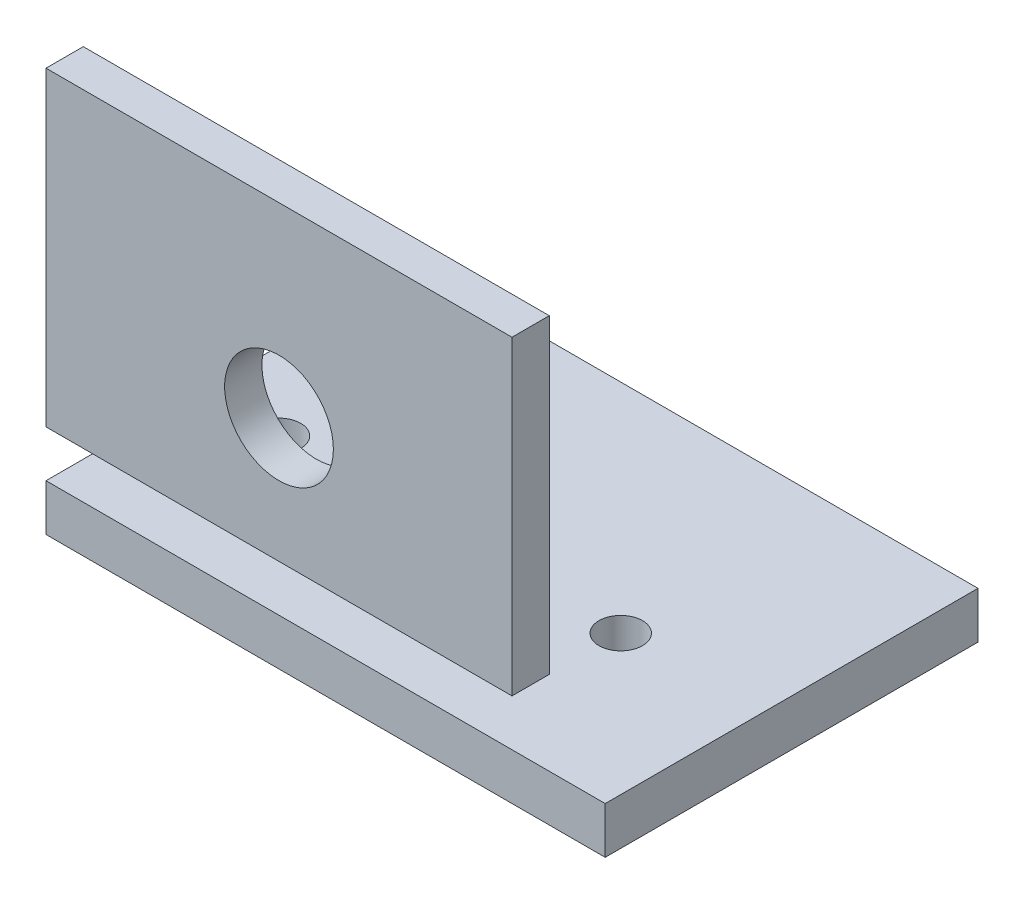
ISO-10303-21;
HEADER;
FILE_DESCRIPTION(('STEP AP214'),'2;1');
FILE_NAME('part.step','',(''),(''),'','','');
FILE_SCHEMA(('AUTOMOTIVE_DESIGN { 1 0 10303 214 1 1 1 1 }'));
ENDSEC;
DATA;
#1=APPLICATION_CONTEXT('core data for automotive mechanical design processes');
#2=APPLICATION_PROTOCOL_DEFINITION('international standard','automotive_design',2000,#1);
#3=PRODUCT_CONTEXT('',#1,'mechanical');
#4=PRODUCT('Part','Part','',(#3));
#5=PRODUCT_RELATED_PRODUCT_CATEGORY('part','',(#4));
#6=PRODUCT_DEFINITION_FORMATION('','',#4);
#7=PRODUCT_DEFINITION_CONTEXT('part definition',#1,'design');
#8=PRODUCT_DEFINITION('design','',#6,#7);
#9=PRODUCT_DEFINITION_SHAPE('','',#8);
#10=(LENGTH_UNIT() NAMED_UNIT(*) SI_UNIT(.MILLI.,.METRE.));
#11=(NAMED_UNIT(*) PLANE_ANGLE_UNIT() SI_UNIT($,.RADIAN.));
#12=(NAMED_UNIT(*) SI_UNIT($,.STERADIAN.) SOLID_ANGLE_UNIT());
#13=UNCERTAINTY_MEASURE_WITH_UNIT(LENGTH_MEASURE(1.E-05),#10,'distance_accuracy_value','');
#14=(GEOMETRIC_REPRESENTATION_CONTEXT(3) GLOBAL_UNCERTAINTY_ASSIGNED_CONTEXT((#13)) GLOBAL_UNIT_ASSIGNED_CONTEXT((#10,
#11,#12)) REPRESENTATION_CONTEXT('',''));
#15=CARTESIAN_POINT('',(0.,0.,0.));
#16=DIRECTION('',(0.,0.,1.));
#17=DIRECTION('',(1.,0.,0.));
#18=AXIS2_PLACEMENT_3D('',#15,#16,#17);
#19=CARTESIAN_POINT('',(0.,15.,-12.));
#20=DIRECTION('',(-1.,0.,0.));
#21=DIRECTION('',(0.,0.,1.));
#22=AXIS2_PLACEMENT_3D('',#19,#20,#21);
#23=PLANE('',#22);
#24=DIRECTION('',(0.,-1.,0.));
#25=VECTOR('',#24,1.);
#26=CARTESIAN_POINT('',(0.,15.,0.));
#27=LINE('',#26,#25);
#28=CARTESIAN_POINT('',(0.,115.,0.));
#29=VERTEX_POINT('',#28);
#30=CARTESIAN_POINT('',(0.,15.,0.));
#31=VERTEX_POINT('',#30);
#32=EDGE_CURVE('E117',#29,#31,#27,.T.);
#33=ORIENTED_EDGE('',*,*,#32,.F.);
#34=DIRECTION('',(0.,0.,1.));
#35=VECTOR('',#34,1.);
#36=CARTESIAN_POINT('',(0.,115.,-12.));
#37=LINE('',#36,#35);
#38=CARTESIAN_POINT('',(0.,115.,-12.));
#39=VERTEX_POINT('',#38);
#40=EDGE_CURVE('E12',#39,#29,#37,.T.);
#41=ORIENTED_EDGE('',*,*,#40,.F.);
#42=DIRECTION('',(0.,-1.,0.));
#43=VECTOR('',#42,1.);
#44=CARTESIAN_POINT('',(0.,15.,-12.));
#45=LINE('',#44,#43);
#46=CARTESIAN_POINT('',(0.,15.,-12.));
#47=VERTEX_POINT('',#46);
#48=EDGE_CURVE('E108',#39,#47,#45,.T.);
#49=ORIENTED_EDGE('',*,*,#48,.T.);
#50=DIRECTION('',(0.,0.,1.));
#51=VECTOR('',#50,1.);
#52=CARTESIAN_POINT('',(0.,15.,-12.));
#53=LINE('',#52,#51);
#54=EDGE_CURVE('E53',#47,#31,#53,.T.);
#55=ORIENTED_EDGE('',*,*,#54,.T.);
#56=EDGE_LOOP('',(#33,#41,#49,#55));
#57=FACE_BOUND('',#56,.T.);
#58=ADVANCED_FACE('F51',(#57),#23,.T.);
#59=CARTESIAN_POINT('',(0.,115.,-12.));
#60=DIRECTION('',(0.,1.,0.));
#61=DIRECTION('',(0.,0.,1.));
#62=AXIS2_PLACEMENT_3D('',#59,#60,#61);
#63=PLANE('',#62);
#64=DIRECTION('',(-1.,0.,0.));
#65=VECTOR('',#64,1.);
#66=CARTESIAN_POINT('',(0.,115.,0.));
#67=LINE('',#66,#65);
#68=CARTESIAN_POINT('',(150.,115.,0.));
#69=VERTEX_POINT('',#68);
#70=EDGE_CURVE('E112',#69,#29,#67,.T.);
#71=ORIENTED_EDGE('',*,*,#70,.F.);
#72=DIRECTION('',(0.,0.,1.));
#73=VECTOR('',#72,1.);
#74=CARTESIAN_POINT('',(150.,115.,-12.));
#75=LINE('',#74,#73);
#76=CARTESIAN_POINT('',(150.,115.,-12.));
#77=VERTEX_POINT('',#76);
#78=EDGE_CURVE('E58',#77,#69,#75,.T.);
#79=ORIENTED_EDGE('',*,*,#78,.F.);
#80=DIRECTION('',(-1.,0.,0.));
#81=VECTOR('',#80,1.);
#82=CARTESIAN_POINT('',(0.,115.,-12.));
#83=LINE('',#82,#81);
#84=EDGE_CURVE('E106',#77,#39,#83,.T.);
#85=ORIENTED_EDGE('',*,*,#84,.T.);
#86=ORIENTED_EDGE('',*,*,#40,.T.);
#87=EDGE_LOOP('',(#71,#79,#85,#86));
#88=FACE_BOUND('',#87,.T.);
#89=ADVANCED_FACE('F130',(#88),#63,.T.);
#90=CARTESIAN_POINT('',(150.,15.,-12.));
#91=DIRECTION('',(1.,0.,0.));
#92=DIRECTION('',(0.,0.,-1.));
#93=AXIS2_PLACEMENT_3D('',#90,#91,#92);
#94=PLANE('',#93);
#95=DIRECTION('',(0.,1.,0.));
#96=VECTOR('',#95,1.);
#97=CARTESIAN_POINT('',(150.,15.,0.));
#98=LINE('',#97,#96);
#99=CARTESIAN_POINT('',(150.,15.,0.));
#100=VERTEX_POINT('',#99);
#101=EDGE_CURVE('E101',#100,#69,#98,.T.);
#102=ORIENTED_EDGE('',*,*,#101,.F.);
#103=DIRECTION('',(0.,0.,1.));
#104=VECTOR('',#103,1.);
#105=CARTESIAN_POINT('',(150.,15.,-12.));
#106=LINE('',#105,#104);
#107=CARTESIAN_POINT('',(150.,15.,-12.));
#108=VERTEX_POINT('',#107);
#109=EDGE_CURVE('E96',#108,#100,#106,.T.);
#110=ORIENTED_EDGE('',*,*,#109,.F.);
#111=DIRECTION('',(0.,1.,0.));
#112=VECTOR('',#111,1.);
#113=CARTESIAN_POINT('',(150.,15.,-12.));
#114=LINE('',#113,#112);
#115=EDGE_CURVE('E97',#108,#77,#114,.T.);
#116=ORIENTED_EDGE('',*,*,#115,.T.);
#117=ORIENTED_EDGE('',*,*,#78,.T.);
#118=EDGE_LOOP('',(#102,#110,#116,#117));
#119=FACE_BOUND('',#118,.T.);
#120=ADVANCED_FACE('F98',(#119),#94,.T.);
#121=CARTESIAN_POINT('',(0.,15.,-12.));
#122=DIRECTION('',(0.,-1.,0.));
#123=DIRECTION('',(0.,0.,-1.));
#124=AXIS2_PLACEMENT_3D('',#121,#122,#123);
#125=PLANE('',#124);
#126=DIRECTION('',(1.,0.,0.));
#127=VECTOR('',#126,1.);
#128=CARTESIAN_POINT('',(0.,15.,0.));
#129=LINE('',#128,#127);
#130=EDGE_CURVE('E116',#31,#100,#129,.T.);
#131=ORIENTED_EDGE('',*,*,#130,.F.);
#132=ORIENTED_EDGE('',*,*,#54,.F.);
#133=DIRECTION('',(1.,0.,0.));
#134=VECTOR('',#133,1.);
#135=CARTESIAN_POINT('',(0.,15.,-12.));
#136=LINE('',#135,#134);
#137=EDGE_CURVE('E104',#47,#108,#136,.T.);
#138=ORIENTED_EDGE('',*,*,#137,.T.);
#139=ORIENTED_EDGE('',*,*,#109,.T.);
#140=EDGE_LOOP('',(#131,#132,#138,#139));
#141=FACE_BOUND('',#140,.T.);
#142=ADVANCED_FACE('F107',(#141),#125,.T.);
#143=CARTESIAN_POINT('',(0.,0.,-12.));
#144=DIRECTION('',(0.,0.,-1.));
#145=DIRECTION('',(-1.,0.,0.));
#146=AXIS2_PLACEMENT_3D('',#143,#144,#145);
#147=PLANE('',#146);
#148=CARTESIAN_POINT('',(75.,55.,-12.));
#149=DIRECTION('',(0.,0.,1.));
#150=DIRECTION('',(1.,0.,0.));
#151=AXIS2_PLACEMENT_3D('',#148,#149,#150);
#152=CIRCLE('',#151,17.5);
#153=CARTESIAN_POINT('',(92.5,55.,-12.));
#154=VERTEX_POINT('',#153);
#155=EDGE_CURVE('E118',#154,#154,#152,.T.);
#156=ORIENTED_EDGE('',*,*,#155,.T.);
#157=EDGE_LOOP('',(#156));
#158=FACE_BOUND('',#157,.T.);
#159=ORIENTED_EDGE('',*,*,#48,.F.);
#160=ORIENTED_EDGE('',*,*,#84,.F.);
#161=ORIENTED_EDGE('',*,*,#115,.F.);
#162=ORIENTED_EDGE('',*,*,#137,.F.);
#163=EDGE_LOOP('',(#159,#160,#161,#162));
#164=FACE_BOUND('',#163,.T.);
#165=ADVANCED_FACE('F102',(#158,#164),#147,.T.);
#166=CARTESIAN_POINT('',(0.,0.,0.));
#167=DIRECTION('',(0.,0.,-1.));
#168=DIRECTION('',(-1.,0.,0.));
#169=AXIS2_PLACEMENT_3D('',#166,#167,#168);
#170=PLANE('',#169);
#171=CARTESIAN_POINT('',(75.,55.,0.));
#172=DIRECTION('',(0.,0.,1.));
#173=DIRECTION('',(1.,0.,0.));
#174=AXIS2_PLACEMENT_3D('',#171,#172,#173);
#175=CIRCLE('',#174,17.5);
#176=CARTESIAN_POINT('',(92.5,55.,0.));
#177=VERTEX_POINT('',#176);
#178=EDGE_CURVE('E160',#177,#177,#175,.T.);
#179=ORIENTED_EDGE('',*,*,#178,.F.);
#180=EDGE_LOOP('',(#179));
#181=FACE_BOUND('',#180,.T.);
#182=ORIENTED_EDGE('',*,*,#32,.T.);
#183=ORIENTED_EDGE('',*,*,#130,.T.);
#184=ORIENTED_EDGE('',*,*,#101,.T.);
#185=ORIENTED_EDGE('',*,*,#70,.T.);
#186=EDGE_LOOP('',(#182,#183,#184,#185));
#187=FACE_BOUND('',#186,.T.);
#188=ADVANCED_FACE('F127',(#181,#187),#170,.F.);
#189=CARTESIAN_POINT('',(75.,55.,-12.));
#190=DIRECTION('',(0.,0.,1.));
#191=DIRECTION('',(1.,0.,0.));
#192=AXIS2_PLACEMENT_3D('',#189,#190,#191);
#193=CYLINDRICAL_SURFACE('',#192,17.5);
#194=ORIENTED_EDGE('',*,*,#155,.F.);
#195=EDGE_LOOP('',(#194));
#196=FACE_BOUND('',#195,.T.);
#197=ORIENTED_EDGE('',*,*,#178,.T.);
#198=EDGE_LOOP('',(#197));
#199=FACE_BOUND('',#198,.T.);
#200=ADVANCED_FACE('F144',(#196,#199),#193,.F.);
#201=CLOSED_SHELL('',(#58,#89,#120,#142,#165,#188,#200));
#202=MANIFOLD_SOLID_BREP('B2',#201);
#203=CARTESIAN_POINT('',(0.,-15.,0.));
#204=DIRECTION('',(-1.,0.,0.));
#205=DIRECTION('',(0.,0.,1.));
#206=AXIS2_PLACEMENT_3D('',#203,#204,#205);
#207=PLANE('',#206);
#208=DIRECTION('',(0.,0.,1.));
#209=VECTOR('',#208,1.);
#210=CARTESIAN_POINT('',(0.,0.,0.));
#211=LINE('',#210,#209);
#212=CARTESIAN_POINT('',(0.,0.,-120.));
#213=VERTEX_POINT('',#212);
#214=CARTESIAN_POINT('',(0.,0.,0.));
#215=VERTEX_POINT('',#214);
#216=EDGE_CURVE('E261',#213,#215,#211,.T.);
#217=ORIENTED_EDGE('',*,*,#216,.F.);
#218=DIRECTION('',(0.,1.,0.));
#219=VECTOR('',#218,1.);
#220=CARTESIAN_POINT('',(0.,-15.,-120.));
#221=LINE('',#220,#219);
#222=CARTESIAN_POINT('',(0.,-15.,-120.));
#223=VERTEX_POINT('',#222);
#224=EDGE_CURVE('E47',#223,#213,#221,.T.);
#225=ORIENTED_EDGE('',*,*,#224,.F.);
#226=DIRECTION('',(0.,0.,1.));
#227=VECTOR('',#226,1.);
#228=CARTESIAN_POINT('',(0.,-15.,0.));
#229=LINE('',#228,#227);
#230=CARTESIAN_POINT('',(0.,-15.,0.));
#231=VERTEX_POINT('',#230);
#232=EDGE_CURVE('E255',#223,#231,#229,.T.);
#233=ORIENTED_EDGE('',*,*,#232,.T.);
#234=DIRECTION('',(0.,1.,0.));
#235=VECTOR('',#234,1.);
#236=CARTESIAN_POINT('',(0.,-15.,0.));
#237=LINE('',#236,#235);
#238=EDGE_CURVE('E200',#231,#215,#237,.T.);
#239=ORIENTED_EDGE('',*,*,#238,.T.);
#240=EDGE_LOOP('',(#217,#225,#233,#239));
#241=FACE_BOUND('',#240,.T.);
#242=ADVANCED_FACE('F198',(#241),#207,.T.);
#243=CARTESIAN_POINT('',(0.,-15.,-120.));
#244=DIRECTION('',(0.,0.,-1.));
#245=DIRECTION('',(-1.,0.,0.));
#246=AXIS2_PLACEMENT_3D('',#243,#244,#245);
#247=PLANE('',#246);
#248=DIRECTION('',(-1.,0.,0.));
#249=VECTOR('',#248,1.);
#250=CARTESIAN_POINT('',(0.,0.,-120.));
#251=LINE('',#250,#249);
#252=CARTESIAN_POINT('',(180.,0.,-120.));
#253=VERTEX_POINT('',#252);
#254=EDGE_CURVE('E258',#253,#213,#251,.T.);
#255=ORIENTED_EDGE('',*,*,#254,.F.);
#256=DIRECTION('',(0.,1.,0.));
#257=VECTOR('',#256,1.);
#258=CARTESIAN_POINT('',(180.,-15.,-120.));
#259=LINE('',#258,#257);
#260=CARTESIAN_POINT('',(180.,-15.,-120.));
#261=VERTEX_POINT('',#260);
#262=EDGE_CURVE('E202',#261,#253,#259,.T.);
#263=ORIENTED_EDGE('',*,*,#262,.F.);
#264=DIRECTION('',(-1.,0.,0.));
#265=VECTOR('',#264,1.);
#266=CARTESIAN_POINT('',(0.,-15.,-120.));
#267=LINE('',#266,#265);
#268=EDGE_CURVE('E253',#261,#223,#267,.T.);
#269=ORIENTED_EDGE('',*,*,#268,.T.);
#270=ORIENTED_EDGE('',*,*,#224,.T.);
#271=EDGE_LOOP('',(#255,#263,#269,#270));
#272=FACE_BOUND('',#271,.T.);
#273=ADVANCED_FACE('F275',(#272),#247,.T.);
#274=CARTESIAN_POINT('',(180.,-15.,0.));
#275=DIRECTION('',(1.,0.,0.));
#276=DIRECTION('',(0.,0.,-1.));
#277=AXIS2_PLACEMENT_3D('',#274,#275,#276);
#278=PLANE('',#277);
#279=DIRECTION('',(0.,0.,-1.));
#280=VECTOR('',#279,1.);
#281=CARTESIAN_POINT('',(180.,0.,0.));
#282=LINE('',#281,#280);
#283=CARTESIAN_POINT('',(180.,0.,0.));
#284=VERTEX_POINT('',#283);
#285=EDGE_CURVE('E246',#284,#253,#282,.T.);
#286=ORIENTED_EDGE('',*,*,#285,.F.);
#287=DIRECTION('',(0.,1.,0.));
#288=VECTOR('',#287,1.);
#289=CARTESIAN_POINT('',(180.,-15.,0.));
#290=LINE('',#289,#288);
#291=CARTESIAN_POINT('',(180.,-15.,0.));
#292=VERTEX_POINT('',#291);
#293=EDGE_CURVE('E242',#292,#284,#290,.T.);
#294=ORIENTED_EDGE('',*,*,#293,.F.);
#295=DIRECTION('',(0.,0.,-1.));
#296=VECTOR('',#295,1.);
#297=CARTESIAN_POINT('',(180.,-15.,0.));
#298=LINE('',#297,#296);
#299=EDGE_CURVE('E241',#292,#261,#298,.T.);
#300=ORIENTED_EDGE('',*,*,#299,.T.);
#301=ORIENTED_EDGE('',*,*,#262,.T.);
#302=EDGE_LOOP('',(#286,#294,#300,#301));
#303=FACE_BOUND('',#302,.T.);
#304=ADVANCED_FACE('F245',(#303),#278,.T.);
#305=CARTESIAN_POINT('',(0.,-15.,0.));
#306=DIRECTION('',(0.,0.,1.));
#307=DIRECTION('',(1.,0.,0.));
#308=AXIS2_PLACEMENT_3D('',#305,#306,#307);
#309=PLANE('',#308);
#310=DIRECTION('',(1.,0.,0.));
#311=VECTOR('',#310,1.);
#312=CARTESIAN_POINT('',(0.,0.,0.));
#313=LINE('',#312,#311);
#314=EDGE_CURVE('E262',#215,#284,#313,.T.);
#315=ORIENTED_EDGE('',*,*,#314,.F.);
#316=ORIENTED_EDGE('',*,*,#238,.F.);
#317=DIRECTION('',(1.,0.,0.));
#318=VECTOR('',#317,1.);
#319=CARTESIAN_POINT('',(0.,-15.,0.));
#320=LINE('',#319,#318);
#321=EDGE_CURVE('E250',#231,#292,#320,.T.);
#322=ORIENTED_EDGE('',*,*,#321,.T.);
#323=ORIENTED_EDGE('',*,*,#293,.T.);
#324=EDGE_LOOP('',(#315,#316,#322,#323));
#325=FACE_BOUND('',#324,.T.);
#326=ADVANCED_FACE('F251',(#325),#309,.T.);
#327=CARTESIAN_POINT('',(0.,-15.,0.));
#328=DIRECTION('',(0.,-1.,0.));
#329=DIRECTION('',(0.,0.,-1.));
#330=AXIS2_PLACEMENT_3D('',#327,#328,#329);
#331=PLANE('',#330);
#332=CARTESIAN_POINT('',(25.,-15.,-50.));
#333=DIRECTION('',(0.,1.,0.));
#334=DIRECTION('',(0.,0.,1.));
#335=AXIS2_PLACEMENT_3D('',#332,#333,#334);
#336=CIRCLE('',#335,7.);
#337=CARTESIAN_POINT('',(25.,-15.,-43.));
#338=VERTEX_POINT('',#337);
#339=EDGE_CURVE('E264',#338,#338,#336,.T.);
#340=ORIENTED_EDGE('',*,*,#339,.T.);
#341=EDGE_LOOP('',(#340));
#342=FACE_BOUND('',#341,.T.);
#343=CARTESIAN_POINT('',(135.,-15.,-50.));
#344=DIRECTION('',(0.,1.,0.));
#345=DIRECTION('',(0.,0.,1.));
#346=AXIS2_PLACEMENT_3D('',#343,#344,#345);
#347=CIRCLE('',#346,7.00000000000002);
#348=CARTESIAN_POINT('',(135.,-15.,-43.));
#349=VERTEX_POINT('',#348);
#350=EDGE_CURVE('E315',#349,#349,#347,.T.);
#351=ORIENTED_EDGE('',*,*,#350,.T.);
#352=EDGE_LOOP('',(#351));
#353=FACE_BOUND('',#352,.T.);
#354=ORIENTED_EDGE('',*,*,#232,.F.);
#355=ORIENTED_EDGE('',*,*,#268,.F.);
#356=ORIENTED_EDGE('',*,*,#299,.F.);
#357=ORIENTED_EDGE('',*,*,#321,.F.);
#358=EDGE_LOOP('',(#354,#355,#356,#357));
#359=FACE_BOUND('',#358,.T.);
#360=ADVANCED_FACE('F248',(#342,#353,#359),#331,.T.);
#361=CARTESIAN_POINT('',(0.,0.,0.));
#362=DIRECTION('',(0.,-1.,0.));
#363=DIRECTION('',(0.,0.,-1.));
#364=AXIS2_PLACEMENT_3D('',#361,#362,#363);
#365=PLANE('',#364);
#366=CARTESIAN_POINT('',(25.,0.,-50.));
#367=DIRECTION('',(0.,1.,0.));
#368=DIRECTION('',(0.,0.,1.));
#369=AXIS2_PLACEMENT_3D('',#366,#367,#368);
#370=CIRCLE('',#369,7.);
#371=CARTESIAN_POINT('',(25.,0.,-43.));
#372=VERTEX_POINT('',#371);
#373=EDGE_CURVE('E307',#372,#372,#370,.T.);
#374=ORIENTED_EDGE('',*,*,#373,.F.);
#375=EDGE_LOOP('',(#374));
#376=FACE_BOUND('',#375,.T.);
#377=CARTESIAN_POINT('',(135.,0.,-50.));
#378=DIRECTION('',(0.,1.,0.));
#379=DIRECTION('',(0.,0.,1.));
#380=AXIS2_PLACEMENT_3D('',#377,#378,#379);
#381=CIRCLE('',#380,7.00000000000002);
#382=CARTESIAN_POINT('',(135.,0.,-43.));
#383=VERTEX_POINT('',#382);
#384=EDGE_CURVE('E306',#383,#383,#381,.T.);
#385=ORIENTED_EDGE('',*,*,#384,.F.);
#386=EDGE_LOOP('',(#385));
#387=FACE_BOUND('',#386,.T.);
#388=ORIENTED_EDGE('',*,*,#216,.T.);
#389=ORIENTED_EDGE('',*,*,#314,.T.);
#390=ORIENTED_EDGE('',*,*,#285,.T.);
#391=ORIENTED_EDGE('',*,*,#254,.T.);
#392=EDGE_LOOP('',(#388,#389,#390,#391));
#393=FACE_BOUND('',#392,.T.);
#394=ADVANCED_FACE('F271',(#376,#387,#393),#365,.F.);
#395=CARTESIAN_POINT('',(135.,-15.,-50.));
#396=DIRECTION('',(0.,1.,0.));
#397=DIRECTION('',(0.,0.,1.));
#398=AXIS2_PLACEMENT_3D('',#395,#396,#397);
#399=CYLINDRICAL_SURFACE('',#398,7.00000000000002);
#400=ORIENTED_EDGE('',*,*,#350,.F.);
#401=EDGE_LOOP('',(#400));
#402=FACE_BOUND('',#401,.T.);
#403=ORIENTED_EDGE('',*,*,#384,.T.);
#404=EDGE_LOOP('',(#403));
#405=FACE_BOUND('',#404,.T.);
#406=ADVANCED_FACE('F290',(#402,#405),#399,.F.);
#407=CARTESIAN_POINT('',(25.,-15.,-50.));
#408=DIRECTION('',(0.,1.,0.));
#409=DIRECTION('',(0.,0.,1.));
#410=AXIS2_PLACEMENT_3D('',#407,#408,#409);
#411=CYLINDRICAL_SURFACE('',#410,7.);
#412=ORIENTED_EDGE('',*,*,#339,.F.);
#413=EDGE_LOOP('',(#412));
#414=FACE_BOUND('',#413,.T.);
#415=ORIENTED_EDGE('',*,*,#373,.T.);
#416=EDGE_LOOP('',(#415));
#417=FACE_BOUND('',#416,.T.);
#418=ADVANCED_FACE('F299',(#414,#417),#411,.F.);
#419=CLOSED_SHELL('',(#242,#273,#304,#326,#360,#394,#406,#418));
#420=MANIFOLD_SOLID_BREP('B6',#419);
#421=ADVANCED_BREP_SHAPE_REPRESENTATION('',(#18,#202,#420),#14);
#422=SHAPE_DEFINITION_REPRESENTATION(#9,#421);
ENDSEC;
END-ISO-10303-21;
